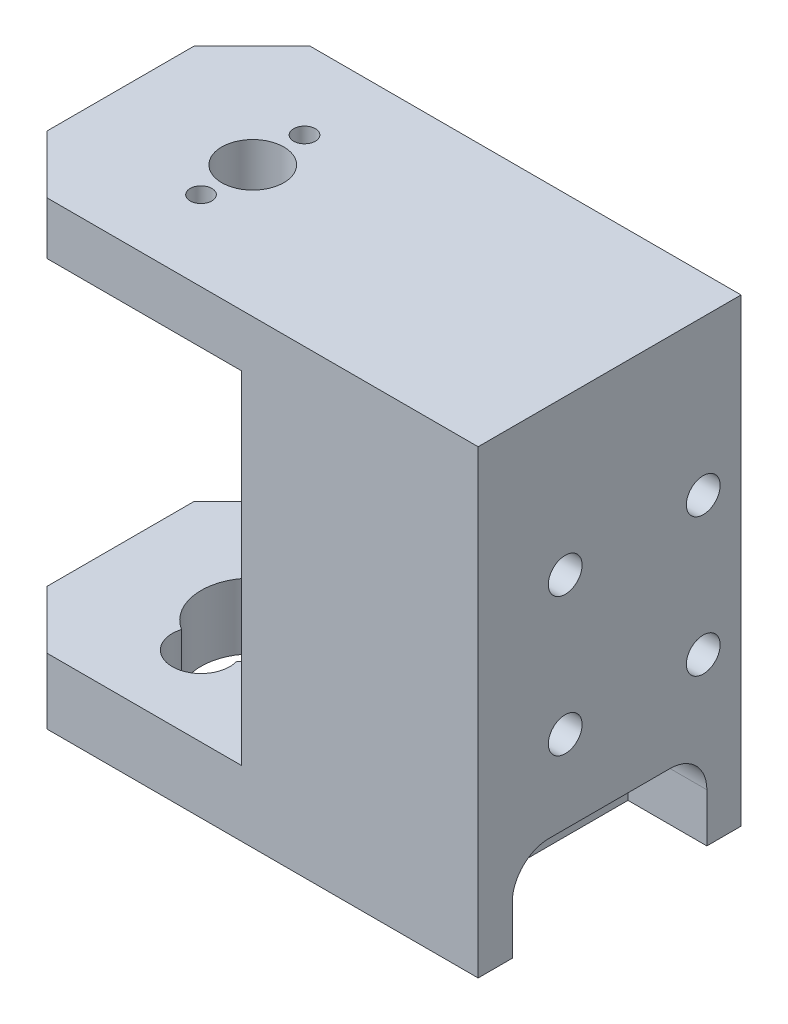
ISO-10303-21;
HEADER;
FILE_DESCRIPTION(('STEP AP214'),'2;1');
FILE_NAME('part.step','',(''),(''),'','','');
FILE_SCHEMA(('AUTOMOTIVE_DESIGN { 1 0 10303 214 1 1 1 1 }'));
ENDSEC;
DATA;
#1=APPLICATION_CONTEXT('core data for automotive mechanical design processes');
#2=APPLICATION_PROTOCOL_DEFINITION('international standard','automotive_design',2000,#1);
#3=PRODUCT_CONTEXT('',#1,'mechanical');
#4=PRODUCT('Part','Part','',(#3));
#5=PRODUCT_RELATED_PRODUCT_CATEGORY('part','',(#4));
#6=PRODUCT_DEFINITION_FORMATION('','',#4);
#7=PRODUCT_DEFINITION_CONTEXT('part definition',#1,'design');
#8=PRODUCT_DEFINITION('design','',#6,#7);
#9=PRODUCT_DEFINITION_SHAPE('','',#8);
#10=(LENGTH_UNIT() NAMED_UNIT(*) SI_UNIT(.MILLI.,.METRE.));
#11=(NAMED_UNIT(*) PLANE_ANGLE_UNIT() SI_UNIT($,.RADIAN.));
#12=(NAMED_UNIT(*) SI_UNIT($,.STERADIAN.) SOLID_ANGLE_UNIT());
#13=UNCERTAINTY_MEASURE_WITH_UNIT(LENGTH_MEASURE(1.E-05),#10,'distance_accuracy_value','');
#14=(GEOMETRIC_REPRESENTATION_CONTEXT(3) GLOBAL_UNCERTAINTY_ASSIGNED_CONTEXT((#13)) GLOBAL_UNIT_ASSIGNED_CONTEXT((#10,
#11,#12)) REPRESENTATION_CONTEXT('',''));
#15=CARTESIAN_POINT('',(0.,0.,0.));
#16=DIRECTION('',(0.,0.,1.));
#17=DIRECTION('',(1.,0.,0.));
#18=AXIS2_PLACEMENT_3D('',#15,#16,#17);
#19=CARTESIAN_POINT('',(-34.47288,0.001000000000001,0.));
#20=DIRECTION('',(0.,-1.,0.));
#21=DIRECTION('',(0.,0.,-1.));
#22=AXIS2_PLACEMENT_3D('',#19,#20,#21);
#23=CYLINDRICAL_SURFACE('',#22,4.9911);
#24=CARTESIAN_POINT('',(-34.47288,-38.1,0.));
#25=DIRECTION('',(0.,1.,0.));
#26=DIRECTION('',(0.,0.,1.));
#27=AXIS2_PLACEMENT_3D('',#24,#25,#26);
#28=CIRCLE('',#27,4.9911);
#29=CARTESIAN_POINT('',(-37.1396181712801,-38.1,4.21895564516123));
#30=VERTEX_POINT('',#29);
#31=CARTESIAN_POINT('',(-37.1396181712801,-38.1,-4.21895564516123));
#32=VERTEX_POINT('',#31);
#33=EDGE_CURVE('E562',#30,#32,#28,.F.);
#34=ORIENTED_EDGE('',*,*,#33,.F.);
#35=DIRECTION('',(0.,-1.,0.));
#36=VECTOR('',#35,1.);
#37=CARTESIAN_POINT('',(-37.1396181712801,-41.275,4.21895564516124));
#38=LINE('',#37,#36);
#39=CARTESIAN_POINT('',(-37.1396181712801,-44.45,4.21895564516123));
#40=VERTEX_POINT('',#39);
#41=EDGE_CURVE('E422',#30,#40,#38,.T.);
#42=ORIENTED_EDGE('',*,*,#41,.T.);
#43=CARTESIAN_POINT('',(-34.47288,-44.45,0.));
#44=DIRECTION('',(0.,-1.,0.));
#45=DIRECTION('',(0.,0.,-1.));
#46=AXIS2_PLACEMENT_3D('',#43,#44,#45);
#47=CIRCLE('',#46,4.9911);
#48=CARTESIAN_POINT('',(-37.1396181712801,-44.45,-4.21895564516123));
#49=VERTEX_POINT('',#48);
#50=EDGE_CURVE('E564',#40,#49,#47,.T.);
#51=ORIENTED_EDGE('',*,*,#50,.T.);
#52=DIRECTION('',(0.,-1.,0.));
#53=VECTOR('',#52,1.);
#54=CARTESIAN_POINT('',(-37.1396181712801,-41.275,-4.21895564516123));
#55=LINE('',#54,#53);
#56=EDGE_CURVE('E407',#49,#32,#55,.F.);
#57=ORIENTED_EDGE('',*,*,#56,.T.);
#58=EDGE_LOOP('',(#34,#42,#51,#57));
#59=FACE_BOUND('',#58,.T.);
#60=ADVANCED_FACE('F32',(#59),#23,.F.);
#61=CARTESIAN_POINT('',(-47.2440000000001,0.,-12.7));
#62=DIRECTION('',(0.,0.,1.));
#63=DIRECTION('',(-1.,0.,0.));
#64=AXIS2_PLACEMENT_3D('',#61,#62,#63);
#65=PLANE('',#64);
#66=CARTESIAN_POINT('',(-10.3854250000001,-41.275,-12.7));
#67=DIRECTION('',(0.,0.,-1.));
#68=DIRECTION('',(-1.,0.,0.));
#69=AXIS2_PLACEMENT_3D('',#66,#67,#68);
#70=CIRCLE('',#69,1.28905);
#71=CARTESIAN_POINT('',(-11.6744750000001,-41.275,-12.7));
#72=VERTEX_POINT('',#71);
#73=EDGE_CURVE('E533',#72,#72,#70,.T.);
#74=ORIENTED_EDGE('',*,*,#73,.F.);
#75=EDGE_LOOP('',(#74));
#76=FACE_BOUND('',#75,.T.);
#77=DIRECTION('',(1.,0.,0.));
#78=VECTOR('',#77,1.);
#79=CARTESIAN_POINT('',(-1.26999999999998,-44.45,-12.7));
#80=LINE('',#79,#78);
#81=CARTESIAN_POINT('',(-13.8652250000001,-44.45,-12.7));
#82=VERTEX_POINT('',#81);
#83=CARTESIAN_POINT('',(0.,-44.45,-12.7));
#84=VERTEX_POINT('',#83);
#85=EDGE_CURVE('E260',#82,#84,#80,.T.);
#86=ORIENTED_EDGE('',*,*,#85,.F.);
#87=DIRECTION('',(0.,-1.,0.));
#88=VECTOR('',#87,1.);
#89=CARTESIAN_POINT('',(-13.8652250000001,-31.75,-12.7));
#90=LINE('',#89,#88);
#91=CARTESIAN_POINT('',(-13.8652250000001,-38.1,-12.7));
#92=VERTEX_POINT('',#91);
#93=EDGE_CURVE('E544',#92,#82,#90,.T.);
#94=ORIENTED_EDGE('',*,*,#93,.F.);
#95=DIRECTION('',(1.,0.,0.));
#96=VECTOR('',#95,1.);
#97=CARTESIAN_POINT('',(-1.26999999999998,-38.1,-12.7));
#98=LINE('',#97,#96);
#99=CARTESIAN_POINT('',(-12.954,-38.1,-12.7));
#100=VERTEX_POINT('',#99);
#101=EDGE_CURVE('E279',#92,#100,#98,.T.);
#102=ORIENTED_EDGE('',*,*,#101,.T.);
#103=CARTESIAN_POINT('',(-12.954,-31.496,-12.7));
#104=DIRECTION('',(0.,0.,1.));
#105=DIRECTION('',(1.,0.,0.));
#106=AXIS2_PLACEMENT_3D('',#103,#104,#105);
#107=CIRCLE('',#106,6.604);
#108=CARTESIAN_POINT('',(-6.34999999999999,-31.496,-12.7));
#109=VERTEX_POINT('',#108);
#110=EDGE_CURVE('E408',#100,#109,#107,.T.);
#111=ORIENTED_EDGE('',*,*,#110,.T.);
#112=DIRECTION('',(0.,-1.,0.));
#113=VECTOR('',#112,1.);
#114=CARTESIAN_POINT('',(-6.35,-5.08,-12.7));
#115=LINE('',#114,#113);
#116=CARTESIAN_POINT('',(-6.35,-11.684,-12.7));
#117=VERTEX_POINT('',#116);
#118=EDGE_CURVE('E298',#117,#109,#115,.T.);
#119=ORIENTED_EDGE('',*,*,#118,.F.);
#120=CARTESIAN_POINT('',(-12.954,-11.684,-12.7));
#121=DIRECTION('',(0.,0.,1.));
#122=DIRECTION('',(1.,0.,0.));
#123=AXIS2_PLACEMENT_3D('',#120,#121,#122);
#124=CIRCLE('',#123,6.604);
#125=CARTESIAN_POINT('',(-12.954,-5.08,-12.7));
#126=VERTEX_POINT('',#125);
#127=EDGE_CURVE('E405',#117,#126,#124,.T.);
#128=ORIENTED_EDGE('',*,*,#127,.T.);
#129=DIRECTION('',(1.,0.,0.));
#130=VECTOR('',#129,1.);
#131=CARTESIAN_POINT('',(-6.35,-5.08,-12.7));
#132=LINE('',#131,#130);
#133=CARTESIAN_POINT('',(-41.656,-5.08,-12.7));
#134=VERTEX_POINT('',#133);
#135=EDGE_CURVE('E302',#134,#126,#132,.T.);
#136=ORIENTED_EDGE('',*,*,#135,.F.);
#137=DIRECTION('',(0.,1.,0.));
#138=VECTOR('',#137,1.);
#139=CARTESIAN_POINT('',(-41.656,0.,-12.7));
#140=LINE('',#139,#138);
#141=CARTESIAN_POINT('',(-41.656,0.,-12.7));
#142=VERTEX_POINT('',#141);
#143=EDGE_CURVE('E353',#134,#142,#140,.T.);
#144=ORIENTED_EDGE('',*,*,#143,.T.);
#145=DIRECTION('',(-1.,0.,0.));
#146=VECTOR('',#145,1.);
#147=CARTESIAN_POINT('',(-47.2440000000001,0.,-12.7));
#148=LINE('',#147,#146);
#149=CARTESIAN_POINT('',(0.,0.,-12.7));
#150=VERTEX_POINT('',#149);
#151=EDGE_CURVE('E303',#150,#142,#148,.T.);
#152=ORIENTED_EDGE('',*,*,#151,.F.);
#153=DIRECTION('',(0.,-1.,0.));
#154=VECTOR('',#153,1.);
#155=CARTESIAN_POINT('',(0.,-44.45,-12.7));
#156=LINE('',#155,#154);
#157=EDGE_CURVE('E560',#150,#84,#156,.T.);
#158=ORIENTED_EDGE('',*,*,#157,.T.);
#159=EDGE_LOOP('',(#86,#94,#102,#111,#119,#128,#136,#144,#152,#158));
#160=FACE_BOUND('',#159,.T.);
#161=ADVANCED_FACE('F403',(#76,#160),#65,.F.);
#162=CARTESIAN_POINT('',(-29.4354250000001,-41.275,-12.7));
#163=DIRECTION('',(0.,0.,-1.));
#164=DIRECTION('',(-1.,0.,0.));
#165=AXIS2_PLACEMENT_3D('',#162,#163,#164);
#166=CIRCLE('',#165,1.28905);
#167=CARTESIAN_POINT('',(-30.7244750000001,-41.275,-12.7));
#168=VERTEX_POINT('',#167);
#169=EDGE_CURVE('E527',#168,#168,#166,.T.);
#170=ORIENTED_EDGE('',*,*,#169,.F.);
#171=EDGE_LOOP('',(#170));
#172=FACE_BOUND('',#171,.T.);
#173=CARTESIAN_POINT('',(-41.656,-38.1,-12.7));
#174=VERTEX_POINT('',#173);
#175=CARTESIAN_POINT('',(-25.0412250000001,-38.1,-12.7));
#176=VERTEX_POINT('',#175);
#177=EDGE_CURVE('E285',#174,#176,#98,.T.);
#178=ORIENTED_EDGE('',*,*,#177,.T.);
#179=DIRECTION('',(0.,-1.,0.));
#180=VECTOR('',#179,1.);
#181=CARTESIAN_POINT('',(-25.0412250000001,-31.75,-12.7));
#182=LINE('',#181,#180);
#183=CARTESIAN_POINT('',(-25.0412250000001,-44.45,-12.7));
#184=VERTEX_POINT('',#183);
#185=EDGE_CURVE('E547',#176,#184,#182,.T.);
#186=ORIENTED_EDGE('',*,*,#185,.T.);
#187=CARTESIAN_POINT('',(-41.656,-44.45,-12.7));
#188=VERTEX_POINT('',#187);
#189=EDGE_CURVE('E255',#188,#184,#80,.T.);
#190=ORIENTED_EDGE('',*,*,#189,.F.);
#191=DIRECTION('',(0.,1.,0.));
#192=VECTOR('',#191,1.);
#193=CARTESIAN_POINT('',(-41.656,0.,-12.7));
#194=LINE('',#193,#192);
#195=EDGE_CURVE('E355',#188,#174,#194,.T.);
#196=ORIENTED_EDGE('',*,*,#195,.T.);
#197=EDGE_LOOP('',(#178,#186,#190,#196));
#198=FACE_BOUND('',#197,.T.);
#199=ADVANCED_FACE('F586',(#172,#198),#65,.F.);
#200=CARTESIAN_POINT('',(-47.2440000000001,-5.08,12.7));
#201=DIRECTION('',(1.,0.,0.));
#202=DIRECTION('',(0.,0.,-1.));
#203=AXIS2_PLACEMENT_3D('',#200,#201,#202);
#204=PLANE('',#203);
#205=DIRECTION('',(0.,0.,-1.));
#206=VECTOR('',#205,1.);
#207=CARTESIAN_POINT('',(-47.2440000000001,0.,12.7));
#208=LINE('',#207,#206);
#209=CARTESIAN_POINT('',(-47.2440000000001,0.,7.11199999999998));
#210=VERTEX_POINT('',#209);
#211=CARTESIAN_POINT('',(-47.2440000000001,0.,-7.11199999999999));
#212=VERTEX_POINT('',#211);
#213=EDGE_CURVE('E346',#210,#212,#208,.T.);
#214=ORIENTED_EDGE('',*,*,#213,.T.);
#215=DIRECTION('',(0.,-1.,0.));
#216=VECTOR('',#215,1.);
#217=CARTESIAN_POINT('',(-47.2440000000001,-5.08,-7.11199999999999));
#218=LINE('',#217,#216);
#219=CARTESIAN_POINT('',(-47.2440000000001,-5.08,-7.11199999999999));
#220=VERTEX_POINT('',#219);
#221=EDGE_CURVE('E382',#212,#220,#218,.T.);
#222=ORIENTED_EDGE('',*,*,#221,.T.);
#223=DIRECTION('',(0.,0.,-1.));
#224=VECTOR('',#223,1.);
#225=CARTESIAN_POINT('',(-47.2440000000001,-5.08,12.7));
#226=LINE('',#225,#224);
#227=CARTESIAN_POINT('',(-47.2440000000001,-5.08,7.11199999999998));
#228=VERTEX_POINT('',#227);
#229=EDGE_CURVE('E308',#228,#220,#226,.T.);
#230=ORIENTED_EDGE('',*,*,#229,.F.);
#231=DIRECTION('',(0.,1.,0.));
#232=VECTOR('',#231,1.);
#233=CARTESIAN_POINT('',(-47.2440000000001,-5.08,7.11199999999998));
#234=LINE('',#233,#232);
#235=EDGE_CURVE('E380',#228,#210,#234,.T.);
#236=ORIENTED_EDGE('',*,*,#235,.T.);
#237=EDGE_LOOP('',(#214,#222,#230,#236));
#238=FACE_BOUND('',#237,.T.);
#239=ADVANCED_FACE('F34',(#238),#204,.F.);
#240=CARTESIAN_POINT('',(-6.35,-5.08,12.7));
#241=DIRECTION('',(0.,1.,0.));
#242=DIRECTION('',(-1.,0.,0.));
#243=AXIS2_PLACEMENT_3D('',#240,#241,#242);
#244=PLANE('',#243);
#245=CARTESIAN_POINT('',(-34.4728800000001,-5.08,4.99999));
#246=DIRECTION('',(0.,-1.,0.));
#247=DIRECTION('',(0.,0.,-1.));
#248=AXIS2_PLACEMENT_3D('',#245,#246,#247);
#249=CIRCLE('',#248,1.985);
#250=CARTESIAN_POINT('',(-34.4728800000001,-5.08,3.01499));
#251=VERTEX_POINT('',#250);
#252=EDGE_CURVE('E479',#251,#251,#249,.T.);
#253=ORIENTED_EDGE('',*,*,#252,.F.);
#254=EDGE_LOOP('',(#253));
#255=FACE_BOUND('',#254,.T.);
#256=CARTESIAN_POINT('',(-34.4728800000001,-5.08,-4.99999));
#257=DIRECTION('',(0.,-1.,0.));
#258=DIRECTION('',(0.,0.,-1.));
#259=AXIS2_PLACEMENT_3D('',#256,#257,#258);
#260=CIRCLE('',#259,1.985);
#261=CARTESIAN_POINT('',(-34.4728800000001,-5.08,-6.98499));
#262=VERTEX_POINT('',#261);
#263=EDGE_CURVE('E491',#262,#262,#260,.T.);
#264=ORIENTED_EDGE('',*,*,#263,.F.);
#265=EDGE_LOOP('',(#264));
#266=FACE_BOUND('',#265,.T.);
#267=ORIENTED_EDGE('',*,*,#135,.T.);
#268=DIRECTION('',(0.,0.,-1.));
#269=VECTOR('',#268,1.);
#270=CARTESIAN_POINT('',(-12.954,-5.08,7.9375));
#271=LINE('',#270,#269);
#272=CARTESIAN_POINT('',(-12.954,-5.08,7.9375));
#273=VERTEX_POINT('',#272);
#274=EDGE_CURVE('E413',#126,#273,#271,.F.);
#275=ORIENTED_EDGE('',*,*,#274,.T.);
#276=DIRECTION('',(-1.,0.,0.));
#277=VECTOR('',#276,1.);
#278=CARTESIAN_POINT('',(-6.35,-5.08,7.9375));
#279=LINE('',#278,#277);
#280=CARTESIAN_POINT('',(-22.86,-5.08,7.9375));
#281=VERTEX_POINT('',#280);
#282=EDGE_CURVE('E321',#273,#281,#279,.T.);
#283=ORIENTED_EDGE('',*,*,#282,.T.);
#284=DIRECTION('',(0.,0.,1.));
#285=VECTOR('',#284,1.);
#286=CARTESIAN_POINT('',(-22.86,-5.08,7.9375));
#287=LINE('',#286,#285);
#288=CARTESIAN_POINT('',(-22.86,-5.08,12.7));
#289=VERTEX_POINT('',#288);
#290=EDGE_CURVE('E312',#281,#289,#287,.T.);
#291=ORIENTED_EDGE('',*,*,#290,.T.);
#292=DIRECTION('',(1.,0.,0.));
#293=VECTOR('',#292,1.);
#294=CARTESIAN_POINT('',(-6.35,-5.08,12.7));
#295=LINE('',#294,#293);
#296=CARTESIAN_POINT('',(-41.656,-5.08,12.7));
#297=VERTEX_POINT('',#296);
#298=EDGE_CURVE('E341',#297,#289,#295,.T.);
#299=ORIENTED_EDGE('',*,*,#298,.F.);
#300=DIRECTION('',(0.707106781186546,0.,0.707106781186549));
#301=VECTOR('',#300,1.);
#302=CARTESIAN_POINT('',(-41.656,-5.08,12.7));
#303=LINE('',#302,#301);
#304=EDGE_CURVE('E385',#297,#228,#303,.F.);
#305=ORIENTED_EDGE('',*,*,#304,.T.);
#306=ORIENTED_EDGE('',*,*,#229,.T.);
#307=DIRECTION('',(-0.707106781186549,0.,0.707106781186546));
#308=VECTOR('',#307,1.);
#309=CARTESIAN_POINT('',(-47.2440000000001,-5.08,-7.11199999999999));
#310=LINE('',#309,#308);
#311=EDGE_CURVE('E387',#220,#134,#310,.F.);
#312=ORIENTED_EDGE('',*,*,#311,.T.);
#313=EDGE_LOOP('',(#267,#275,#283,#291,#299,#305,#306,#312));
#314=FACE_BOUND('',#313,.T.);
#315=CARTESIAN_POINT('',(-34.4728800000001,-5.08,0.));
#316=DIRECTION('',(0.,1.,0.));
#317=DIRECTION('',(-1.,0.,0.));
#318=AXIS2_PLACEMENT_3D('',#315,#316,#317);
#319=CIRCLE('',#318,2.9972);
#320=CARTESIAN_POINT('',(-37.4700800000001,-5.08,0.));
#321=VERTEX_POINT('',#320);
#322=EDGE_CURVE('E497',#321,#321,#319,.F.);
#323=ORIENTED_EDGE('',*,*,#322,.F.);
#324=EDGE_LOOP('',(#323));
#325=FACE_BOUND('',#324,.T.);
#326=ADVANCED_FACE('F399',(#255,#266,#314,#325),#244,.F.);
#327=CARTESIAN_POINT('',(-6.35,-5.08,12.7));
#328=DIRECTION('',(1.,0.,0.));
#329=DIRECTION('',(0.,1.,0.));
#330=AXIS2_PLACEMENT_3D('',#327,#328,#329);
#331=PLANE('',#330);
#332=CARTESIAN_POINT('',(-6.35,-14.9225,4.28625));
#333=DIRECTION('',(1.,0.,0.));
#334=DIRECTION('',(0.,1.,0.));
#335=AXIS2_PLACEMENT_3D('',#332,#333,#334);
#336=CIRCLE('',#335,1.63194999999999);
#337=CARTESIAN_POINT('',(-6.35,-13.29055,4.28625));
#338=VERTEX_POINT('',#337);
#339=EDGE_CURVE('E503',#338,#338,#336,.T.);
#340=ORIENTED_EDGE('',*,*,#339,.T.);
#341=EDGE_LOOP('',(#340));
#342=FACE_BOUND('',#341,.T.);
#343=CARTESIAN_POINT('',(-6.35,-14.9225,-9.04875));
#344=DIRECTION('',(1.,0.,0.));
#345=DIRECTION('',(0.,1.,0.));
#346=AXIS2_PLACEMENT_3D('',#343,#344,#345);
#347=CIRCLE('',#346,1.63194999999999);
#348=CARTESIAN_POINT('',(-6.35,-13.29055,-9.04875));
#349=VERTEX_POINT('',#348);
#350=EDGE_CURVE('E509',#349,#349,#347,.T.);
#351=ORIENTED_EDGE('',*,*,#350,.T.);
#352=EDGE_LOOP('',(#351));
#353=FACE_BOUND('',#352,.T.);
#354=CARTESIAN_POINT('',(-6.34999999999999,-28.2575,4.28625));
#355=DIRECTION('',(1.,0.,0.));
#356=DIRECTION('',(0.,1.,0.));
#357=AXIS2_PLACEMENT_3D('',#354,#355,#356);
#358=CIRCLE('',#357,1.63194999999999);
#359=CARTESIAN_POINT('',(-6.34999999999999,-26.62555,4.28625));
#360=VERTEX_POINT('',#359);
#361=EDGE_CURVE('E515',#360,#360,#358,.T.);
#362=ORIENTED_EDGE('',*,*,#361,.T.);
#363=EDGE_LOOP('',(#362));
#364=FACE_BOUND('',#363,.T.);
#365=CARTESIAN_POINT('',(-6.34999999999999,-28.2575,-9.04875));
#366=DIRECTION('',(1.,0.,0.));
#367=DIRECTION('',(0.,1.,0.));
#368=AXIS2_PLACEMENT_3D('',#365,#366,#367);
#369=CIRCLE('',#368,1.63194999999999);
#370=CARTESIAN_POINT('',(-6.34999999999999,-26.62555,-9.04875));
#371=VERTEX_POINT('',#370);
#372=EDGE_CURVE('E521',#371,#371,#369,.T.);
#373=ORIENTED_EDGE('',*,*,#372,.T.);
#374=EDGE_LOOP('',(#373));
#375=FACE_BOUND('',#374,.T.);
#376=ORIENTED_EDGE('',*,*,#118,.T.);
#377=DIRECTION('',(0.,0.,-1.));
#378=VECTOR('',#377,1.);
#379=CARTESIAN_POINT('',(-6.34999999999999,-31.496,12.7));
#380=LINE('',#379,#378);
#381=CARTESIAN_POINT('',(-6.34999999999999,-31.496,7.9375));
#382=VERTEX_POINT('',#381);
#383=EDGE_CURVE('E753',#109,#382,#380,.F.);
#384=ORIENTED_EDGE('',*,*,#383,.T.);
#385=DIRECTION('',(0.,1.,0.));
#386=VECTOR('',#385,1.);
#387=CARTESIAN_POINT('',(-6.35,-5.08,7.9375));
#388=LINE('',#387,#386);
#389=CARTESIAN_POINT('',(-6.35,-11.684,7.9375));
#390=VERTEX_POINT('',#389);
#391=EDGE_CURVE('E270',#382,#390,#388,.T.);
#392=ORIENTED_EDGE('',*,*,#391,.T.);
#393=DIRECTION('',(0.,0.,-1.));
#394=VECTOR('',#393,1.);
#395=CARTESIAN_POINT('',(-6.35,-11.684,-12.7));
#396=LINE('',#395,#394);
#397=EDGE_CURVE('E297',#390,#117,#396,.T.);
#398=ORIENTED_EDGE('',*,*,#397,.T.);
#399=EDGE_LOOP('',(#376,#384,#392,#398));
#400=FACE_BOUND('',#399,.T.);
#401=ADVANCED_FACE('F626',(#342,#353,#364,#375,#400),#331,.F.);
#402=CARTESIAN_POINT('',(0.,0.,12.7));
#403=DIRECTION('',(-1.,0.,0.));
#404=DIRECTION('',(0.,-1.,0.));
#405=AXIS2_PLACEMENT_3D('',#402,#403,#404);
#406=PLANE('',#405);
#407=CARTESIAN_POINT('',(0.,-14.9225,4.28625));
#408=DIRECTION('',(1.,0.,0.));
#409=DIRECTION('',(0.,0.,-1.));
#410=AXIS2_PLACEMENT_3D('',#407,#408,#409);
#411=CIRCLE('',#410,1.63194999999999);
#412=CARTESIAN_POINT('',(0.,-14.9225,2.65430000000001));
#413=VERTEX_POINT('',#412);
#414=EDGE_CURVE('E500',#413,#413,#411,.T.);
#415=ORIENTED_EDGE('',*,*,#414,.F.);
#416=EDGE_LOOP('',(#415));
#417=FACE_BOUND('',#416,.T.);
#418=CARTESIAN_POINT('',(0.,-14.9225,-9.04875));
#419=DIRECTION('',(1.,0.,0.));
#420=DIRECTION('',(0.,0.,-1.));
#421=AXIS2_PLACEMENT_3D('',#418,#419,#420);
#422=CIRCLE('',#421,1.63194999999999);
#423=CARTESIAN_POINT('',(0.,-14.9225,-10.6807));
#424=VERTEX_POINT('',#423);
#425=EDGE_CURVE('E506',#424,#424,#422,.T.);
#426=ORIENTED_EDGE('',*,*,#425,.F.);
#427=EDGE_LOOP('',(#426));
#428=FACE_BOUND('',#427,.T.);
#429=CARTESIAN_POINT('',(0.,-28.2575,4.28625));
#430=DIRECTION('',(1.,0.,0.));
#431=DIRECTION('',(0.,0.,-1.));
#432=AXIS2_PLACEMENT_3D('',#429,#430,#431);
#433=CIRCLE('',#432,1.63194999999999);
#434=CARTESIAN_POINT('',(0.,-28.2575,2.65430000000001));
#435=VERTEX_POINT('',#434);
#436=EDGE_CURVE('E512',#435,#435,#433,.T.);
#437=ORIENTED_EDGE('',*,*,#436,.F.);
#438=EDGE_LOOP('',(#437));
#439=FACE_BOUND('',#438,.T.);
#440=CARTESIAN_POINT('',(0.,-28.2575,-9.04875));
#441=DIRECTION('',(1.,0.,0.));
#442=DIRECTION('',(0.,0.,-1.));
#443=AXIS2_PLACEMENT_3D('',#440,#441,#442);
#444=CIRCLE('',#443,1.63194999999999);
#445=CARTESIAN_POINT('',(0.,-28.2575,-10.6807));
#446=VERTEX_POINT('',#445);
#447=EDGE_CURVE('E518',#446,#446,#444,.T.);
#448=ORIENTED_EDGE('',*,*,#447,.F.);
#449=EDGE_LOOP('',(#448));
#450=FACE_BOUND('',#449,.T.);
#451=DIRECTION('',(0.,0.,1.));
#452=VECTOR('',#451,1.);
#453=CARTESIAN_POINT('',(0.,-44.45,8.9916));
#454=LINE('',#453,#452);
#455=CARTESIAN_POINT('',(0.,-44.45,9.398));
#456=VERTEX_POINT('',#455);
#457=CARTESIAN_POINT('',(0.,-44.45,12.7));
#458=VERTEX_POINT('',#457);
#459=EDGE_CURVE('E242',#456,#458,#454,.T.);
#460=ORIENTED_EDGE('',*,*,#459,.F.);
#461=DIRECTION('',(0.,-1.,0.));
#462=VECTOR('',#461,1.);
#463=CARTESIAN_POINT('',(0.,-44.45,9.398));
#464=LINE('',#463,#462);
#465=CARTESIAN_POINT('',(0.,-39.751,9.398));
#466=VERTEX_POINT('',#465);
#467=EDGE_CURVE('E229',#466,#456,#464,.T.);
#468=ORIENTED_EDGE('',*,*,#467,.F.);
#469=CARTESIAN_POINT('',(0.,-39.751,5.842));
#470=DIRECTION('',(-1.,0.,0.));
#471=DIRECTION('',(0.,-1.,0.));
#472=AXIS2_PLACEMENT_3D('',#469,#470,#471);
#473=CIRCLE('',#472,3.556);
#474=CARTESIAN_POINT('',(0.,-36.195,5.842));
#475=VERTEX_POINT('',#474);
#476=EDGE_CURVE('E11',#466,#475,#473,.T.);
#477=ORIENTED_EDGE('',*,*,#476,.T.);
#478=DIRECTION('',(0.,0.,1.));
#479=VECTOR('',#478,1.);
#480=CARTESIAN_POINT('',(0.,-36.195,9.398));
#481=LINE('',#480,#479);
#482=CARTESIAN_POINT('',(0.,-36.195,-5.842));
#483=VERTEX_POINT('',#482);
#484=EDGE_CURVE('E440',#483,#475,#481,.T.);
#485=ORIENTED_EDGE('',*,*,#484,.F.);
#486=CARTESIAN_POINT('',(0.,-39.751,-5.842));
#487=DIRECTION('',(-1.,0.,0.));
#488=DIRECTION('',(0.,-1.,0.));
#489=AXIS2_PLACEMENT_3D('',#486,#487,#488);
#490=CIRCLE('',#489,3.556);
#491=CARTESIAN_POINT('',(0.,-39.751,-9.398));
#492=VERTEX_POINT('',#491);
#493=EDGE_CURVE('E40',#483,#492,#490,.T.);
#494=ORIENTED_EDGE('',*,*,#493,.T.);
#495=DIRECTION('',(0.,1.,0.));
#496=VECTOR('',#495,1.);
#497=CARTESIAN_POINT('',(0.,-44.45,-9.398));
#498=LINE('',#497,#496);
#499=CARTESIAN_POINT('',(0.,-44.45,-9.398));
#500=VERTEX_POINT('',#499);
#501=EDGE_CURVE('E237',#500,#492,#498,.T.);
#502=ORIENTED_EDGE('',*,*,#501,.F.);
#503=EDGE_CURVE('E254',#84,#500,#454,.T.);
#504=ORIENTED_EDGE('',*,*,#503,.F.);
#505=ORIENTED_EDGE('',*,*,#157,.F.);
#506=DIRECTION('',(0.,0.,-1.));
#507=VECTOR('',#506,1.);
#508=CARTESIAN_POINT('',(0.,0.,12.7));
#509=LINE('',#508,#507);
#510=CARTESIAN_POINT('',(0.,0.,12.7));
#511=VERTEX_POINT('',#510);
#512=EDGE_CURVE('E348',#511,#150,#509,.T.);
#513=ORIENTED_EDGE('',*,*,#512,.F.);
#514=DIRECTION('',(0.,-1.,0.));
#515=VECTOR('',#514,1.);
#516=CARTESIAN_POINT('',(0.,-44.45,12.7));
#517=LINE('',#516,#515);
#518=EDGE_CURVE('E253',#511,#458,#517,.T.);
#519=ORIENTED_EDGE('',*,*,#518,.T.);
#520=EDGE_LOOP('',(#460,#468,#477,#485,#494,#502,#504,#505,#513,#519));
#521=FACE_BOUND('',#520,.T.);
#522=ADVANCED_FACE('F251',(#417,#428,#439,#450,#521),#406,.F.);
#523=CARTESIAN_POINT('',(-47.2440000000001,0.,12.7));
#524=DIRECTION('',(0.,-1.,0.));
#525=DIRECTION('',(0.,0.,-1.));
#526=AXIS2_PLACEMENT_3D('',#523,#524,#525);
#527=PLANE('',#526);
#528=CARTESIAN_POINT('',(-34.4728800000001,0.,4.99999));
#529=DIRECTION('',(0.,-1.,0.));
#530=DIRECTION('',(0.,0.,-1.));
#531=AXIS2_PLACEMENT_3D('',#528,#529,#530);
#532=CIRCLE('',#531,1.05);
#533=CARTESIAN_POINT('',(-34.4728800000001,0.,3.94999));
#534=VERTEX_POINT('',#533);
#535=EDGE_CURVE('E470',#534,#534,#532,.T.);
#536=ORIENTED_EDGE('',*,*,#535,.T.);
#537=EDGE_LOOP('',(#536));
#538=FACE_BOUND('',#537,.T.);
#539=CARTESIAN_POINT('',(-34.4728800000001,0.,-4.99999));
#540=DIRECTION('',(0.,-1.,0.));
#541=DIRECTION('',(0.,0.,-1.));
#542=AXIS2_PLACEMENT_3D('',#539,#540,#541);
#543=CIRCLE('',#542,1.05);
#544=CARTESIAN_POINT('',(-34.4728800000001,0.,-6.04999));
#545=VERTEX_POINT('',#544);
#546=EDGE_CURVE('E482',#545,#545,#543,.T.);
#547=ORIENTED_EDGE('',*,*,#546,.T.);
#548=EDGE_LOOP('',(#547));
#549=FACE_BOUND('',#548,.T.);
#550=ORIENTED_EDGE('',*,*,#151,.T.);
#551=DIRECTION('',(0.707106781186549,0.,-0.707106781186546));
#552=VECTOR('',#551,1.);
#553=CARTESIAN_POINT('',(-47.2440000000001,0.,-7.11199999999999));
#554=LINE('',#553,#552);
#555=EDGE_CURVE('E292',#142,#212,#554,.F.);
#556=ORIENTED_EDGE('',*,*,#555,.T.);
#557=ORIENTED_EDGE('',*,*,#213,.F.);
#558=DIRECTION('',(-0.707106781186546,0.,-0.707106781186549));
#559=VECTOR('',#558,1.);
#560=CARTESIAN_POINT('',(-41.656,0.,12.7));
#561=LINE('',#560,#559);
#562=CARTESIAN_POINT('',(-41.656,0.,12.7));
#563=VERTEX_POINT('',#562);
#564=EDGE_CURVE('E388',#210,#563,#561,.F.);
#565=ORIENTED_EDGE('',*,*,#564,.T.);
#566=DIRECTION('',(-1.,0.,0.));
#567=VECTOR('',#566,1.);
#568=CARTESIAN_POINT('',(-47.2440000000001,0.,12.7));
#569=LINE('',#568,#567);
#570=EDGE_CURVE('E343',#511,#563,#569,.T.);
#571=ORIENTED_EDGE('',*,*,#570,.F.);
#572=ORIENTED_EDGE('',*,*,#512,.T.);
#573=EDGE_LOOP('',(#550,#556,#557,#565,#571,#572));
#574=FACE_BOUND('',#573,.T.);
#575=CARTESIAN_POINT('',(-34.4728800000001,0.,0.));
#576=DIRECTION('',(0.,1.,0.));
#577=DIRECTION('',(-1.,0.,0.));
#578=AXIS2_PLACEMENT_3D('',#575,#576,#577);
#579=CIRCLE('',#578,2.9972);
#580=CARTESIAN_POINT('',(-37.4700800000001,0.,0.));
#581=VERTEX_POINT('',#580);
#582=EDGE_CURVE('E494',#581,#581,#579,.T.);
#583=ORIENTED_EDGE('',*,*,#582,.F.);
#584=EDGE_LOOP('',(#583));
#585=FACE_BOUND('',#584,.T.);
#586=ADVANCED_FACE('F392',(#538,#549,#574,#585),#527,.F.);
#587=CARTESIAN_POINT('',(-47.2440000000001,0.,12.7));
#588=DIRECTION('',(0.,0.,-1.));
#589=DIRECTION('',(-1.,0.,0.));
#590=AXIS2_PLACEMENT_3D('',#587,#588,#589);
#591=PLANE('',#590);
#592=DIRECTION('',(-1.,0.,0.));
#593=VECTOR('',#592,1.);
#594=CARTESIAN_POINT('',(-1.26999999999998,-38.1,12.7));
#595=LINE('',#594,#593);
#596=CARTESIAN_POINT('',(-22.86,-38.1,12.7));
#597=VERTEX_POINT('',#596);
#598=CARTESIAN_POINT('',(-41.656,-38.1,12.7));
#599=VERTEX_POINT('',#598);
#600=EDGE_CURVE('E264',#597,#599,#595,.T.);
#601=ORIENTED_EDGE('',*,*,#600,.T.);
#602=DIRECTION('',(0.,-1.,0.));
#603=VECTOR('',#602,1.);
#604=CARTESIAN_POINT('',(-41.656,0.,12.7));
#605=LINE('',#604,#603);
#606=CARTESIAN_POINT('',(-41.656,-44.45,12.7));
#607=VERTEX_POINT('',#606);
#608=EDGE_CURVE('E378',#599,#607,#605,.T.);
#609=ORIENTED_EDGE('',*,*,#608,.T.);
#610=DIRECTION('',(-1.,0.,0.));
#611=VECTOR('',#610,1.);
#612=CARTESIAN_POINT('',(-1.26999999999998,-44.45,12.7));
#613=LINE('',#612,#611);
#614=EDGE_CURVE('E282',#458,#607,#613,.T.);
#615=ORIENTED_EDGE('',*,*,#614,.F.);
#616=ORIENTED_EDGE('',*,*,#518,.F.);
#617=ORIENTED_EDGE('',*,*,#570,.T.);
#618=DIRECTION('',(0.,-1.,0.));
#619=VECTOR('',#618,1.);
#620=CARTESIAN_POINT('',(-41.656,0.,12.7));
#621=LINE('',#620,#619);
#622=EDGE_CURVE('E375',#563,#297,#621,.T.);
#623=ORIENTED_EDGE('',*,*,#622,.T.);
#624=ORIENTED_EDGE('',*,*,#298,.T.);
#625=DIRECTION('',(0.,-1.,0.));
#626=VECTOR('',#625,1.);
#627=CARTESIAN_POINT('',(-22.86,-5.08,12.7));
#628=LINE('',#627,#626);
#629=EDGE_CURVE('E258',#289,#597,#628,.T.);
#630=ORIENTED_EDGE('',*,*,#629,.T.);
#631=EDGE_LOOP('',(#601,#609,#615,#616,#617,#623,#624,#630));
#632=FACE_BOUND('',#631,.T.);
#633=ADVANCED_FACE('F614',(#632),#591,.F.);
#634=CARTESIAN_POINT('',(-22.86,-5.08,7.9375));
#635=DIRECTION('',(-1.,0.,0.));
#636=DIRECTION('',(0.,-1.,0.));
#637=AXIS2_PLACEMENT_3D('',#634,#635,#636);
#638=PLANE('',#637);
#639=ORIENTED_EDGE('',*,*,#629,.F.);
#640=ORIENTED_EDGE('',*,*,#290,.F.);
#641=DIRECTION('',(0.,-1.,0.));
#642=VECTOR('',#641,1.);
#643=CARTESIAN_POINT('',(-22.86,-5.08,7.9375));
#644=LINE('',#643,#642);
#645=CARTESIAN_POINT('',(-22.86,-38.1,7.9375));
#646=VERTEX_POINT('',#645);
#647=EDGE_CURVE('E326',#281,#646,#644,.T.);
#648=ORIENTED_EDGE('',*,*,#647,.T.);
#649=DIRECTION('',(0.,0.,1.));
#650=VECTOR('',#649,1.);
#651=CARTESIAN_POINT('',(-22.86,-38.1,7.9375));
#652=LINE('',#651,#650);
#653=EDGE_CURVE('E310',#646,#597,#652,.T.);
#654=ORIENTED_EDGE('',*,*,#653,.T.);
#655=EDGE_LOOP('',(#639,#640,#648,#654));
#656=FACE_BOUND('',#655,.T.);
#657=ADVANCED_FACE('F611',(#656),#638,.T.);
#658=CARTESIAN_POINT('',(-6.35,-5.08,7.9375));
#659=DIRECTION('',(0.,0.,-1.));
#660=DIRECTION('',(-1.,0.,0.));
#661=AXIS2_PLACEMENT_3D('',#658,#659,#660);
#662=PLANE('',#661);
#663=ORIENTED_EDGE('',*,*,#391,.F.);
#664=CARTESIAN_POINT('',(-12.954,-31.496,7.9375));
#665=DIRECTION('',(0.,0.,-1.));
#666=DIRECTION('',(-1.,0.,0.));
#667=AXIS2_PLACEMENT_3D('',#664,#665,#666);
#668=CIRCLE('',#667,6.604);
#669=CARTESIAN_POINT('',(-12.954,-38.1,7.9375));
#670=VERTEX_POINT('',#669);
#671=EDGE_CURVE('E749',#382,#670,#668,.T.);
#672=ORIENTED_EDGE('',*,*,#671,.T.);
#673=DIRECTION('',(1.,0.,0.));
#674=VECTOR('',#673,1.);
#675=CARTESIAN_POINT('',(-6.34999999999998,-38.1,7.9375));
#676=LINE('',#675,#674);
#677=EDGE_CURVE('E331',#646,#670,#676,.T.);
#678=ORIENTED_EDGE('',*,*,#677,.F.);
#679=ORIENTED_EDGE('',*,*,#647,.F.);
#680=ORIENTED_EDGE('',*,*,#282,.F.);
#681=CARTESIAN_POINT('',(-12.954,-11.684,7.9375));
#682=DIRECTION('',(0.,0.,-1.));
#683=DIRECTION('',(-1.,0.,0.));
#684=AXIS2_PLACEMENT_3D('',#681,#682,#683);
#685=CIRCLE('',#684,6.604);
#686=EDGE_CURVE('E751',#273,#390,#685,.T.);
#687=ORIENTED_EDGE('',*,*,#686,.T.);
#688=EDGE_LOOP('',(#663,#672,#678,#679,#680,#687));
#689=FACE_BOUND('',#688,.T.);
#690=ADVANCED_FACE('F608',(#689),#662,.T.);
#691=CARTESIAN_POINT('',(-1.26999999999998,-38.1,8.9916));
#692=DIRECTION('',(0.,1.,0.));
#693=DIRECTION('',(0.,0.,1.));
#694=AXIS2_PLACEMENT_3D('',#691,#692,#693);
#695=PLANE('',#694);
#696=CARTESIAN_POINT('',(-34.4728800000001,-38.1,4.99999));
#697=DIRECTION('',(0.,1.,0.));
#698=DIRECTION('',(0.,0.,1.));
#699=AXIS2_PLACEMENT_3D('',#696,#697,#698);
#700=CIRCLE('',#699,2.77876);
#701=CARTESIAN_POINT('',(-31.8061418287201,-38.1,4.21895564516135));
#702=VERTEX_POINT('',#701);
#703=EDGE_CURVE('E462',#702,#30,#700,.F.);
#704=ORIENTED_EDGE('',*,*,#703,.T.);
#705=ORIENTED_EDGE('',*,*,#33,.T.);
#706=CARTESIAN_POINT('',(-34.4728800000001,-38.1,-4.99999));
#707=DIRECTION('',(0.,1.,0.));
#708=DIRECTION('',(0.,0.,1.));
#709=AXIS2_PLACEMENT_3D('',#706,#707,#708);
#710=CIRCLE('',#709,2.77876);
#711=CARTESIAN_POINT('',(-31.8061418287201,-38.1,-4.21895564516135));
#712=VERTEX_POINT('',#711);
#713=EDGE_CURVE('E467',#32,#712,#710,.F.);
#714=ORIENTED_EDGE('',*,*,#713,.T.);
#715=EDGE_CURVE('E275',#712,#702,#28,.F.);
#716=ORIENTED_EDGE('',*,*,#715,.T.);
#717=EDGE_LOOP('',(#704,#705,#714,#716));
#718=FACE_BOUND('',#717,.T.);
#719=ORIENTED_EDGE('',*,*,#677,.T.);
#720=DIRECTION('',(0.,0.,-1.));
#721=VECTOR('',#720,1.);
#722=CARTESIAN_POINT('',(-12.954,-38.1,8.9916));
#723=LINE('',#722,#721);
#724=EDGE_CURVE('E294',#670,#100,#723,.T.);
#725=ORIENTED_EDGE('',*,*,#724,.T.);
#726=ORIENTED_EDGE('',*,*,#101,.F.);
#727=DIRECTION('',(0.,0.,-1.));
#728=VECTOR('',#727,1.);
#729=CARTESIAN_POINT('',(-13.8652250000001,-38.1,8.9916));
#730=LINE('',#729,#728);
#731=CARTESIAN_POINT('',(-13.8652250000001,-38.1,-10.16));
#732=VERTEX_POINT('',#731);
#733=EDGE_CURVE('E557',#732,#92,#730,.T.);
#734=ORIENTED_EDGE('',*,*,#733,.F.);
#735=DIRECTION('',(1.,0.,0.));
#736=VECTOR('',#735,1.);
#737=CARTESIAN_POINT('',(-1.26999999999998,-38.1,-10.16));
#738=LINE('',#737,#736);
#739=CARTESIAN_POINT('',(-25.0412250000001,-38.1,-10.16));
#740=VERTEX_POINT('',#739);
#741=EDGE_CURVE('E546',#740,#732,#738,.T.);
#742=ORIENTED_EDGE('',*,*,#741,.F.);
#743=DIRECTION('',(0.,0.,1.));
#744=VECTOR('',#743,1.);
#745=CARTESIAN_POINT('',(-25.0412250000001,-38.1,8.99160000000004));
#746=LINE('',#745,#744);
#747=EDGE_CURVE('E555',#176,#740,#746,.T.);
#748=ORIENTED_EDGE('',*,*,#747,.F.);
#749=ORIENTED_EDGE('',*,*,#177,.F.);
#750=DIRECTION('',(0.707106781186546,0.,-0.707106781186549));
#751=VECTOR('',#750,1.);
#752=CARTESIAN_POINT('',(-32.3088000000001,-38.1,-22.0472));
#753=LINE('',#752,#751);
#754=CARTESIAN_POINT('',(-47.244,-38.1,-7.11199999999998));
#755=VERTEX_POINT('',#754);
#756=EDGE_CURVE('E364',#174,#755,#753,.F.);
#757=ORIENTED_EDGE('',*,*,#756,.T.);
#758=DIRECTION('',(0.,0.,-1.));
#759=VECTOR('',#758,1.);
#760=CARTESIAN_POINT('',(-47.244,-38.1,12.7));
#761=LINE('',#760,#759);
#762=CARTESIAN_POINT('',(-47.244,-38.1,7.11199999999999));
#763=VERTEX_POINT('',#762);
#764=EDGE_CURVE('E268',#763,#755,#761,.T.);
#765=ORIENTED_EDGE('',*,*,#764,.F.);
#766=DIRECTION('',(-0.707106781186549,0.,-0.707106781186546));
#767=VECTOR('',#766,1.);
#768=CARTESIAN_POINT('',(-23.3171999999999,-38.1,31.0388));
#769=LINE('',#768,#767);
#770=EDGE_CURVE('E360',#763,#599,#769,.F.);
#771=ORIENTED_EDGE('',*,*,#770,.T.);
#772=ORIENTED_EDGE('',*,*,#600,.F.);
#773=ORIENTED_EDGE('',*,*,#653,.F.);
#774=EDGE_LOOP('',(#719,#725,#726,#734,#742,#748,#749,#757,#765,#771,#772,#773));
#775=FACE_BOUND('',#774,.T.);
#776=ADVANCED_FACE('F575',(#718,#775),#695,.T.);
#777=CARTESIAN_POINT('',(-47.244,-44.45,12.7));
#778=DIRECTION('',(1.,0.,0.));
#779=DIRECTION('',(0.,0.,-1.));
#780=AXIS2_PLACEMENT_3D('',#777,#778,#779);
#781=PLANE('',#780);
#782=ORIENTED_EDGE('',*,*,#764,.T.);
#783=DIRECTION('',(0.,-1.,0.));
#784=VECTOR('',#783,1.);
#785=CARTESIAN_POINT('',(-47.244,-44.45,-7.11199999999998));
#786=LINE('',#785,#784);
#787=CARTESIAN_POINT('',(-47.244,-44.45,-7.11199999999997));
#788=VERTEX_POINT('',#787);
#789=EDGE_CURVE('E369',#755,#788,#786,.T.);
#790=ORIENTED_EDGE('',*,*,#789,.T.);
#791=DIRECTION('',(0.,0.,-1.));
#792=VECTOR('',#791,1.);
#793=CARTESIAN_POINT('',(-47.244,-44.45,12.7));
#794=LINE('',#793,#792);
#795=CARTESIAN_POINT('',(-47.244,-44.45,7.11199999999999));
#796=VERTEX_POINT('',#795);
#797=EDGE_CURVE('E723',#796,#788,#794,.T.);
#798=ORIENTED_EDGE('',*,*,#797,.F.);
#799=DIRECTION('',(0.,1.,0.));
#800=VECTOR('',#799,1.);
#801=CARTESIAN_POINT('',(-47.244,-44.45,7.11199999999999));
#802=LINE('',#801,#800);
#803=EDGE_CURVE('E366',#796,#763,#802,.T.);
#804=ORIENTED_EDGE('',*,*,#803,.T.);
#805=EDGE_LOOP('',(#782,#790,#798,#804));
#806=FACE_BOUND('',#805,.T.);
#807=ADVANCED_FACE('F599',(#806),#781,.F.);
#808=CARTESIAN_POINT('',(-1.26999999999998,-44.45,8.9916));
#809=DIRECTION('',(0.,1.,0.));
#810=DIRECTION('',(0.,0.,1.));
#811=AXIS2_PLACEMENT_3D('',#808,#809,#810);
#812=PLANE('',#811);
#813=ORIENTED_EDGE('',*,*,#50,.F.);
#814=CARTESIAN_POINT('',(-34.4728800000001,-44.45,4.99999));
#815=DIRECTION('',(0.,-1.,0.));
#816=DIRECTION('',(0.,0.,-1.));
#817=AXIS2_PLACEMENT_3D('',#814,#815,#816);
#818=CIRCLE('',#817,2.77876);
#819=CARTESIAN_POINT('',(-31.8061418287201,-44.45,4.21895564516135));
#820=VERTEX_POINT('',#819);
#821=EDGE_CURVE('E459',#820,#40,#818,.T.);
#822=ORIENTED_EDGE('',*,*,#821,.F.);
#823=CARTESIAN_POINT('',(-31.8061418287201,-44.45,-4.21895564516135));
#824=VERTEX_POINT('',#823);
#825=EDGE_CURVE('E269',#824,#820,#47,.T.);
#826=ORIENTED_EDGE('',*,*,#825,.F.);
#827=CARTESIAN_POINT('',(-34.4728800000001,-44.45,-4.99999));
#828=DIRECTION('',(0.,-1.,0.));
#829=DIRECTION('',(0.,0.,-1.));
#830=AXIS2_PLACEMENT_3D('',#827,#828,#829);
#831=CIRCLE('',#830,2.77876);
#832=EDGE_CURVE('E465',#49,#824,#831,.T.);
#833=ORIENTED_EDGE('',*,*,#832,.F.);
#834=EDGE_LOOP('',(#813,#822,#826,#833));
#835=FACE_BOUND('',#834,.T.);
#836=DIRECTION('',(0.,0.,-1.));
#837=VECTOR('',#836,1.);
#838=CARTESIAN_POINT('',(-7.61999999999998,-44.45,9.398));
#839=LINE('',#838,#837);
#840=CARTESIAN_POINT('',(-7.61999999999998,-44.45,9.398));
#841=VERTEX_POINT('',#840);
#842=CARTESIAN_POINT('',(-7.61999999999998,-44.45,-9.398));
#843=VERTEX_POINT('',#842);
#844=EDGE_CURVE('E246',#841,#843,#839,.T.);
#845=ORIENTED_EDGE('',*,*,#844,.F.);
#846=DIRECTION('',(1.,0.,0.));
#847=VECTOR('',#846,1.);
#848=CARTESIAN_POINT('',(-7.61999999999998,-44.45,9.398));
#849=LINE('',#848,#847);
#850=EDGE_CURVE('E232',#841,#456,#849,.T.);
#851=ORIENTED_EDGE('',*,*,#850,.T.);
#852=ORIENTED_EDGE('',*,*,#459,.T.);
#853=ORIENTED_EDGE('',*,*,#614,.T.);
#854=DIRECTION('',(0.707106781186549,0.,0.707106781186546));
#855=VECTOR('',#854,1.);
#856=CARTESIAN_POINT('',(-47.244,-44.45,7.11199999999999));
#857=LINE('',#856,#855);
#858=EDGE_CURVE('E371',#607,#796,#857,.F.);
#859=ORIENTED_EDGE('',*,*,#858,.T.);
#860=ORIENTED_EDGE('',*,*,#797,.T.);
#861=DIRECTION('',(-0.707106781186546,0.,0.707106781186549));
#862=VECTOR('',#861,1.);
#863=CARTESIAN_POINT('',(-41.656,-44.45,-12.7));
#864=LINE('',#863,#862);
#865=EDGE_CURVE('E373',#788,#188,#864,.F.);
#866=ORIENTED_EDGE('',*,*,#865,.T.);
#867=ORIENTED_EDGE('',*,*,#189,.T.);
#868=DIRECTION('',(0.,0.,-1.));
#869=VECTOR('',#868,1.);
#870=CARTESIAN_POINT('',(-25.0412250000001,-44.45,-12.7));
#871=LINE('',#870,#869);
#872=CARTESIAN_POINT('',(-25.0412250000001,-44.45,-10.16));
#873=VERTEX_POINT('',#872);
#874=EDGE_CURVE('E541',#873,#184,#871,.T.);
#875=ORIENTED_EDGE('',*,*,#874,.F.);
#876=DIRECTION('',(-1.,0.,0.));
#877=VECTOR('',#876,1.);
#878=CARTESIAN_POINT('',(-13.8652250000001,-44.45,-10.16));
#879=LINE('',#878,#877);
#880=CARTESIAN_POINT('',(-13.8652250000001,-44.45,-10.16));
#881=VERTEX_POINT('',#880);
#882=EDGE_CURVE('E538',#881,#873,#879,.T.);
#883=ORIENTED_EDGE('',*,*,#882,.F.);
#884=DIRECTION('',(0.,0.,1.));
#885=VECTOR('',#884,1.);
#886=CARTESIAN_POINT('',(-13.8652250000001,-44.45,-12.7));
#887=LINE('',#886,#885);
#888=EDGE_CURVE('E536',#82,#881,#887,.T.);
#889=ORIENTED_EDGE('',*,*,#888,.F.);
#890=ORIENTED_EDGE('',*,*,#85,.T.);
#891=ORIENTED_EDGE('',*,*,#503,.T.);
#892=DIRECTION('',(1.,0.,0.));
#893=VECTOR('',#892,1.);
#894=CARTESIAN_POINT('',(-7.61999999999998,-44.45,-9.398));
#895=LINE('',#894,#893);
#896=EDGE_CURVE('E247',#843,#500,#895,.T.);
#897=ORIENTED_EDGE('',*,*,#896,.F.);
#898=EDGE_LOOP('',(#845,#851,#852,#853,#859,#860,#866,#867,#875,#883,#889,#890,#891,#897));
#899=FACE_BOUND('',#898,.T.);
#900=ADVANCED_FACE('F240',(#835,#899),#812,.F.);
#901=ORIENTED_EDGE('',*,*,#825,.T.);
#902=DIRECTION('',(0.,-1.,0.));
#903=VECTOR('',#902,1.);
#904=CARTESIAN_POINT('',(-31.8061418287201,-41.275,4.21895564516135));
#905=LINE('',#904,#903);
#906=EDGE_CURVE('E419',#820,#702,#905,.F.);
#907=ORIENTED_EDGE('',*,*,#906,.T.);
#908=ORIENTED_EDGE('',*,*,#715,.F.);
#909=DIRECTION('',(0.,-1.,0.));
#910=VECTOR('',#909,1.);
#911=CARTESIAN_POINT('',(-31.8061418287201,-41.275,-4.21895564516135));
#912=LINE('',#911,#910);
#913=EDGE_CURVE('E411',#712,#824,#912,.T.);
#914=ORIENTED_EDGE('',*,*,#913,.T.);
#915=EDGE_LOOP('',(#901,#907,#908,#914));
#916=FACE_BOUND('',#915,.T.);
#917=ADVANCED_FACE('F582',(#916),#23,.F.);
#918=CARTESIAN_POINT('',(-41.656,0.,-12.7));
#919=DIRECTION('',(0.70710678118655,0.,0.707106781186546));
#920=DIRECTION('',(0.707106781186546,0.,-0.707106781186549));
#921=AXIS2_PLACEMENT_3D('',#918,#919,#920);
#922=PLANE('',#921);
#923=ORIENTED_EDGE('',*,*,#865,.F.);
#924=ORIENTED_EDGE('',*,*,#789,.F.);
#925=ORIENTED_EDGE('',*,*,#756,.F.);
#926=ORIENTED_EDGE('',*,*,#195,.F.);
#927=EDGE_LOOP('',(#923,#924,#925,#926));
#928=FACE_BOUND('',#927,.T.);
#929=ADVANCED_FACE('F592',(#928),#922,.F.);
#930=CARTESIAN_POINT('',(-47.244,-44.45,7.11199999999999));
#931=DIRECTION('',(0.707106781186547,0.,-0.707106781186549));
#932=DIRECTION('',(-0.707106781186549,0.,-0.707106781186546));
#933=AXIS2_PLACEMENT_3D('',#930,#931,#932);
#934=PLANE('',#933);
#935=ORIENTED_EDGE('',*,*,#858,.F.);
#936=ORIENTED_EDGE('',*,*,#608,.F.);
#937=ORIENTED_EDGE('',*,*,#770,.F.);
#938=ORIENTED_EDGE('',*,*,#803,.F.);
#939=EDGE_LOOP('',(#935,#936,#937,#938));
#940=FACE_BOUND('',#939,.T.);
#941=ADVANCED_FACE('F597',(#940),#934,.F.);
#942=CARTESIAN_POINT('',(-47.2440000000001,-5.08,-7.11199999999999));
#943=DIRECTION('',(0.707106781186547,0.,0.707106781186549));
#944=DIRECTION('',(0.707106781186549,0.,-0.707106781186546));
#945=AXIS2_PLACEMENT_3D('',#942,#943,#944);
#946=PLANE('',#945);
#947=ORIENTED_EDGE('',*,*,#555,.F.);
#948=ORIENTED_EDGE('',*,*,#143,.F.);
#949=ORIENTED_EDGE('',*,*,#311,.F.);
#950=ORIENTED_EDGE('',*,*,#221,.F.);
#951=EDGE_LOOP('',(#947,#948,#949,#950));
#952=FACE_BOUND('',#951,.T.);
#953=ADVANCED_FACE('F398',(#952),#946,.F.);
#954=CARTESIAN_POINT('',(-41.656,0.,12.7));
#955=DIRECTION('',(0.70710678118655,0.,-0.707106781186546));
#956=DIRECTION('',(-0.707106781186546,0.,-0.707106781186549));
#957=AXIS2_PLACEMENT_3D('',#954,#955,#956);
#958=PLANE('',#957);
#959=ORIENTED_EDGE('',*,*,#564,.F.);
#960=ORIENTED_EDGE('',*,*,#235,.F.);
#961=ORIENTED_EDGE('',*,*,#304,.F.);
#962=ORIENTED_EDGE('',*,*,#622,.F.);
#963=EDGE_LOOP('',(#959,#960,#961,#962));
#964=FACE_BOUND('',#963,.T.);
#965=ADVANCED_FACE('F707',(#964),#958,.F.);
#966=CARTESIAN_POINT('',(-13.8652250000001,-31.75,-12.7));
#967=DIRECTION('',(1.,0.,0.));
#968=DIRECTION('',(0.,0.,-1.));
#969=AXIS2_PLACEMENT_3D('',#966,#967,#968);
#970=PLANE('',#969);
#971=ORIENTED_EDGE('',*,*,#733,.T.);
#972=ORIENTED_EDGE('',*,*,#93,.T.);
#973=ORIENTED_EDGE('',*,*,#888,.T.);
#974=DIRECTION('',(0.,-1.,0.));
#975=VECTOR('',#974,1.);
#976=CARTESIAN_POINT('',(-13.8652250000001,-31.75,-10.16));
#977=LINE('',#976,#975);
#978=EDGE_CURVE('E543',#732,#881,#977,.T.);
#979=ORIENTED_EDGE('',*,*,#978,.F.);
#980=EDGE_LOOP('',(#971,#972,#973,#979));
#981=FACE_BOUND('',#980,.T.);
#982=ADVANCED_FACE('F700',(#981),#970,.F.);
#983=CARTESIAN_POINT('',(-25.0412250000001,-31.75,-12.7));
#984=DIRECTION('',(-1.,0.,0.));
#985=DIRECTION('',(0.,0.,1.));
#986=AXIS2_PLACEMENT_3D('',#983,#984,#985);
#987=PLANE('',#986);
#988=ORIENTED_EDGE('',*,*,#747,.T.);
#989=DIRECTION('',(0.,-1.,0.));
#990=VECTOR('',#989,1.);
#991=CARTESIAN_POINT('',(-25.0412250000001,-31.75,-10.16));
#992=LINE('',#991,#990);
#993=EDGE_CURVE('E550',#740,#873,#992,.T.);
#994=ORIENTED_EDGE('',*,*,#993,.T.);
#995=ORIENTED_EDGE('',*,*,#874,.T.);
#996=ORIENTED_EDGE('',*,*,#185,.F.);
#997=EDGE_LOOP('',(#988,#994,#995,#996));
#998=FACE_BOUND('',#997,.T.);
#999=ADVANCED_FACE('F697',(#998),#987,.F.);
#1000=CARTESIAN_POINT('',(-13.8652250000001,-31.75,-10.16));
#1001=DIRECTION('',(0.,0.,1.));
#1002=DIRECTION('',(1.,0.,0.));
#1003=AXIS2_PLACEMENT_3D('',#1000,#1001,#1002);
#1004=PLANE('',#1003);
#1005=ORIENTED_EDGE('',*,*,#741,.T.);
#1006=ORIENTED_EDGE('',*,*,#978,.T.);
#1007=ORIENTED_EDGE('',*,*,#882,.T.);
#1008=ORIENTED_EDGE('',*,*,#993,.F.);
#1009=EDGE_LOOP('',(#1005,#1006,#1007,#1008));
#1010=FACE_BOUND('',#1009,.T.);
#1011=ADVANCED_FACE('F695',(#1010),#1004,.F.);
#1012=CARTESIAN_POINT('',(-10.3854250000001,-41.275,-12.7));
#1013=DIRECTION('',(0.,0.,-1.));
#1014=DIRECTION('',(-1.,0.,0.));
#1015=AXIS2_PLACEMENT_3D('',#1012,#1013,#1014);
#1016=CYLINDRICAL_SURFACE('',#1015,1.28905);
#1017=CARTESIAN_POINT('',(-10.3854250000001,-41.275,-5.715));
#1018=DIRECTION('',(0.,0.,-1.));
#1019=DIRECTION('',(-1.,0.,0.));
#1020=AXIS2_PLACEMENT_3D('',#1017,#1018,#1019);
#1021=CIRCLE('',#1020,1.28905);
#1022=CARTESIAN_POINT('',(-11.6744750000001,-41.275,-5.715));
#1023=VERTEX_POINT('',#1022);
#1024=EDGE_CURVE('E530',#1023,#1023,#1021,.T.);
#1025=ORIENTED_EDGE('',*,*,#1024,.F.);
#1026=EDGE_LOOP('',(#1025));
#1027=FACE_BOUND('',#1026,.T.);
#1028=ORIENTED_EDGE('',*,*,#73,.T.);
#1029=EDGE_LOOP('',(#1028));
#1030=FACE_BOUND('',#1029,.T.);
#1031=ADVANCED_FACE('F691',(#1027,#1030),#1016,.F.);
#1032=CARTESIAN_POINT('',(-10.3854250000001,-41.275,-5.715));
#1033=DIRECTION('',(0.,0.,1.));
#1034=DIRECTION('',(1.,0.,0.));
#1035=AXIS2_PLACEMENT_3D('',#1032,#1033,#1034);
#1036=PLANE('',#1035);
#1037=ORIENTED_EDGE('',*,*,#1024,.T.);
#1038=EDGE_LOOP('',(#1037));
#1039=FACE_BOUND('',#1038,.T.);
#1040=ADVANCED_FACE('F687',(#1039),#1036,.F.);
#1041=CARTESIAN_POINT('',(-29.4354250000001,-41.275,-12.7));
#1042=DIRECTION('',(0.,0.,-1.));
#1043=DIRECTION('',(-1.,0.,0.));
#1044=AXIS2_PLACEMENT_3D('',#1041,#1042,#1043);
#1045=CYLINDRICAL_SURFACE('',#1044,1.28905);
#1046=CARTESIAN_POINT('',(-29.4354250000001,-41.275,-5.715));
#1047=DIRECTION('',(0.,0.,-1.));
#1048=DIRECTION('',(-1.,0.,0.));
#1049=AXIS2_PLACEMENT_3D('',#1046,#1047,#1048);
#1050=CIRCLE('',#1049,1.28905);
#1051=CARTESIAN_POINT('',(-30.7244750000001,-41.275,-5.715));
#1052=VERTEX_POINT('',#1051);
#1053=EDGE_CURVE('E524',#1052,#1052,#1050,.T.);
#1054=ORIENTED_EDGE('',*,*,#1053,.F.);
#1055=EDGE_LOOP('',(#1054));
#1056=FACE_BOUND('',#1055,.T.);
#1057=ORIENTED_EDGE('',*,*,#169,.T.);
#1058=EDGE_LOOP('',(#1057));
#1059=FACE_BOUND('',#1058,.T.);
#1060=ADVANCED_FACE('F683',(#1056,#1059),#1045,.F.);
#1061=CARTESIAN_POINT('',(-29.4354250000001,-41.275,-5.715));
#1062=DIRECTION('',(0.,0.,1.));
#1063=DIRECTION('',(1.,0.,0.));
#1064=AXIS2_PLACEMENT_3D('',#1061,#1062,#1063);
#1065=PLANE('',#1064);
#1066=ORIENTED_EDGE('',*,*,#1053,.T.);
#1067=EDGE_LOOP('',(#1066));
#1068=FACE_BOUND('',#1067,.T.);
#1069=ADVANCED_FACE('F679',(#1068),#1065,.F.);
#1070=CARTESIAN_POINT('',(-12.954,-31.496,8.9916));
#1071=DIRECTION('',(0.,0.,-1.));
#1072=DIRECTION('',(-1.,0.,0.));
#1073=AXIS2_PLACEMENT_3D('',#1070,#1071,#1072);
#1074=CYLINDRICAL_SURFACE('',#1073,6.604);
#1075=ORIENTED_EDGE('',*,*,#671,.F.);
#1076=ORIENTED_EDGE('',*,*,#383,.F.);
#1077=ORIENTED_EDGE('',*,*,#110,.F.);
#1078=ORIENTED_EDGE('',*,*,#724,.F.);
#1079=EDGE_LOOP('',(#1075,#1076,#1077,#1078));
#1080=FACE_BOUND('',#1079,.T.);
#1081=ADVANCED_FACE('F676',(#1080),#1074,.F.);
#1082=CARTESIAN_POINT('',(-12.954,-11.684,12.7));
#1083=DIRECTION('',(0.,0.,1.));
#1084=DIRECTION('',(1.,0.,0.));
#1085=AXIS2_PLACEMENT_3D('',#1082,#1083,#1084);
#1086=CYLINDRICAL_SURFACE('',#1085,6.604);
#1087=ORIENTED_EDGE('',*,*,#686,.F.);
#1088=ORIENTED_EDGE('',*,*,#274,.F.);
#1089=ORIENTED_EDGE('',*,*,#127,.F.);
#1090=ORIENTED_EDGE('',*,*,#397,.F.);
#1091=EDGE_LOOP('',(#1087,#1088,#1089,#1090));
#1092=FACE_BOUND('',#1091,.T.);
#1093=ADVANCED_FACE('F672',(#1092),#1086,.F.);
#1094=CARTESIAN_POINT('',(0.,-28.2575,-9.04875));
#1095=DIRECTION('',(1.,0.,0.));
#1096=DIRECTION('',(0.,0.,-1.));
#1097=AXIS2_PLACEMENT_3D('',#1094,#1095,#1096);
#1098=CYLINDRICAL_SURFACE('',#1097,1.63194999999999);
#1099=ORIENTED_EDGE('',*,*,#447,.T.);
#1100=EDGE_LOOP('',(#1099));
#1101=FACE_BOUND('',#1100,.T.);
#1102=ORIENTED_EDGE('',*,*,#372,.F.);
#1103=EDGE_LOOP('',(#1102));
#1104=FACE_BOUND('',#1103,.T.);
#1105=ADVANCED_FACE('F668',(#1101,#1104),#1098,.F.);
#1106=CARTESIAN_POINT('',(0.,-28.2575,4.28625));
#1107=DIRECTION('',(1.,0.,0.));
#1108=DIRECTION('',(0.,0.,-1.));
#1109=AXIS2_PLACEMENT_3D('',#1106,#1107,#1108);
#1110=CYLINDRICAL_SURFACE('',#1109,1.63194999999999);
#1111=ORIENTED_EDGE('',*,*,#436,.T.);
#1112=EDGE_LOOP('',(#1111));
#1113=FACE_BOUND('',#1112,.T.);
#1114=ORIENTED_EDGE('',*,*,#361,.F.);
#1115=EDGE_LOOP('',(#1114));
#1116=FACE_BOUND('',#1115,.T.);
#1117=ADVANCED_FACE('F664',(#1113,#1116),#1110,.F.);
#1118=CARTESIAN_POINT('',(0.,-14.9225,-9.04875));
#1119=DIRECTION('',(1.,0.,0.));
#1120=DIRECTION('',(0.,0.,-1.));
#1121=AXIS2_PLACEMENT_3D('',#1118,#1119,#1120);
#1122=CYLINDRICAL_SURFACE('',#1121,1.63194999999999);
#1123=ORIENTED_EDGE('',*,*,#425,.T.);
#1124=EDGE_LOOP('',(#1123));
#1125=FACE_BOUND('',#1124,.T.);
#1126=ORIENTED_EDGE('',*,*,#350,.F.);
#1127=EDGE_LOOP('',(#1126));
#1128=FACE_BOUND('',#1127,.T.);
#1129=ADVANCED_FACE('F660',(#1125,#1128),#1122,.F.);
#1130=CARTESIAN_POINT('',(0.,-14.9225,4.28625));
#1131=DIRECTION('',(1.,0.,0.));
#1132=DIRECTION('',(0.,0.,-1.));
#1133=AXIS2_PLACEMENT_3D('',#1130,#1131,#1132);
#1134=CYLINDRICAL_SURFACE('',#1133,1.63194999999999);
#1135=ORIENTED_EDGE('',*,*,#414,.T.);
#1136=EDGE_LOOP('',(#1135));
#1137=FACE_BOUND('',#1136,.T.);
#1138=ORIENTED_EDGE('',*,*,#339,.F.);
#1139=EDGE_LOOP('',(#1138));
#1140=FACE_BOUND('',#1139,.T.);
#1141=ADVANCED_FACE('F652',(#1137,#1140),#1134,.F.);
#1142=CARTESIAN_POINT('',(-34.4728800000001,-19.2149231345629,0.));
#1143=DIRECTION('',(0.,1.,0.));
#1144=DIRECTION('',(-1.,0.,0.));
#1145=AXIS2_PLACEMENT_3D('',#1142,#1143,#1144);
#1146=CYLINDRICAL_SURFACE('',#1145,2.9972);
#1147=ORIENTED_EDGE('',*,*,#322,.T.);
#1148=EDGE_LOOP('',(#1147));
#1149=FACE_BOUND('',#1148,.T.);
#1150=ORIENTED_EDGE('',*,*,#582,.T.);
#1151=EDGE_LOOP('',(#1150));
#1152=FACE_BOUND('',#1151,.T.);
#1153=ADVANCED_FACE('F642',(#1149,#1152),#1146,.F.);
#1154=CARTESIAN_POINT('',(-34.4728800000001,-5.08,-4.99999));
#1155=DIRECTION('',(0.,-1.,0.));
#1156=DIRECTION('',(0.,0.,-1.));
#1157=AXIS2_PLACEMENT_3D('',#1154,#1155,#1156);
#1158=CYLINDRICAL_SURFACE('',#1157,1.985);
#1159=CARTESIAN_POINT('',(-34.4728800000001,-2.08,-4.99999));
#1160=DIRECTION('',(0.,-1.,0.));
#1161=DIRECTION('',(0.,0.,-1.));
#1162=AXIS2_PLACEMENT_3D('',#1159,#1160,#1161);
#1163=CIRCLE('',#1162,1.985);
#1164=CARTESIAN_POINT('',(-34.4728800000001,-2.08,-6.98499));
#1165=VERTEX_POINT('',#1164);
#1166=EDGE_CURVE('E488',#1165,#1165,#1163,.T.);
#1167=ORIENTED_EDGE('',*,*,#1166,.F.);
#1168=EDGE_LOOP('',(#1167));
#1169=FACE_BOUND('',#1168,.T.);
#1170=ORIENTED_EDGE('',*,*,#263,.T.);
#1171=EDGE_LOOP('',(#1170));
#1172=FACE_BOUND('',#1171,.T.);
#1173=ADVANCED_FACE('F639',(#1169,#1172),#1158,.F.);
#1174=CARTESIAN_POINT('',(-33.4228800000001,-2.08,-4.99999));
#1175=DIRECTION('',(0.,1.,0.));
#1176=DIRECTION('',(0.,0.,1.));
#1177=AXIS2_PLACEMENT_3D('',#1174,#1175,#1176);
#1178=PLANE('',#1177);
#1179=CARTESIAN_POINT('',(-34.4728800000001,-2.08,-4.99999));
#1180=DIRECTION('',(0.,-1.,0.));
#1181=DIRECTION('',(0.,0.,-1.));
#1182=AXIS2_PLACEMENT_3D('',#1179,#1180,#1181);
#1183=CIRCLE('',#1182,1.05);
#1184=CARTESIAN_POINT('',(-34.4728800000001,-2.08,-6.04999));
#1185=VERTEX_POINT('',#1184);
#1186=EDGE_CURVE('E485',#1185,#1185,#1183,.T.);
#1187=ORIENTED_EDGE('',*,*,#1186,.F.);
#1188=EDGE_LOOP('',(#1187));
#1189=FACE_BOUND('',#1188,.T.);
#1190=ORIENTED_EDGE('',*,*,#1166,.T.);
#1191=EDGE_LOOP('',(#1190));
#1192=FACE_BOUND('',#1191,.T.);
#1193=ADVANCED_FACE('F641',(#1189,#1192),#1178,.F.);
#1194=CARTESIAN_POINT('',(-34.4728800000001,-5.08,-4.99999));
#1195=DIRECTION('',(0.,-1.,0.));
#1196=DIRECTION('',(0.,0.,-1.));
#1197=AXIS2_PLACEMENT_3D('',#1194,#1195,#1196);
#1198=CYLINDRICAL_SURFACE('',#1197,1.05);
#1199=ORIENTED_EDGE('',*,*,#546,.F.);
#1200=EDGE_LOOP('',(#1199));
#1201=FACE_BOUND('',#1200,.T.);
#1202=ORIENTED_EDGE('',*,*,#1186,.T.);
#1203=EDGE_LOOP('',(#1202));
#1204=FACE_BOUND('',#1203,.T.);
#1205=ADVANCED_FACE('F649',(#1201,#1204),#1198,.F.);
#1206=CARTESIAN_POINT('',(-34.4728800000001,-5.08,4.99999));
#1207=DIRECTION('',(0.,-1.,0.));
#1208=DIRECTION('',(0.,0.,-1.));
#1209=AXIS2_PLACEMENT_3D('',#1206,#1207,#1208);
#1210=CYLINDRICAL_SURFACE('',#1209,1.985);
#1211=CARTESIAN_POINT('',(-34.4728800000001,-2.08,4.99999));
#1212=DIRECTION('',(0.,-1.,0.));
#1213=DIRECTION('',(0.,0.,-1.));
#1214=AXIS2_PLACEMENT_3D('',#1211,#1212,#1213);
#1215=CIRCLE('',#1214,1.985);
#1216=CARTESIAN_POINT('',(-34.4728800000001,-2.08,3.01499));
#1217=VERTEX_POINT('',#1216);
#1218=EDGE_CURVE('E476',#1217,#1217,#1215,.T.);
#1219=ORIENTED_EDGE('',*,*,#1218,.F.);
#1220=EDGE_LOOP('',(#1219));
#1221=FACE_BOUND('',#1220,.T.);
#1222=ORIENTED_EDGE('',*,*,#252,.T.);
#1223=EDGE_LOOP('',(#1222));
#1224=FACE_BOUND('',#1223,.T.);
#1225=ADVANCED_FACE('F954',(#1221,#1224),#1210,.F.);
#1226=CARTESIAN_POINT('',(-33.4228800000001,-2.08,4.99999));
#1227=DIRECTION('',(0.,1.,0.));
#1228=DIRECTION('',(0.,0.,1.));
#1229=AXIS2_PLACEMENT_3D('',#1226,#1227,#1228);
#1230=PLANE('',#1229);
#1231=CARTESIAN_POINT('',(-34.4728800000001,-2.08,4.99999));
#1232=DIRECTION('',(0.,-1.,0.));
#1233=DIRECTION('',(0.,0.,-1.));
#1234=AXIS2_PLACEMENT_3D('',#1231,#1232,#1233);
#1235=CIRCLE('',#1234,1.05);
#1236=CARTESIAN_POINT('',(-34.4728800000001,-2.08,3.94999));
#1237=VERTEX_POINT('',#1236);
#1238=EDGE_CURVE('E473',#1237,#1237,#1235,.T.);
#1239=ORIENTED_EDGE('',*,*,#1238,.F.);
#1240=EDGE_LOOP('',(#1239));
#1241=FACE_BOUND('',#1240,.T.);
#1242=ORIENTED_EDGE('',*,*,#1218,.T.);
#1243=EDGE_LOOP('',(#1242));
#1244=FACE_BOUND('',#1243,.T.);
#1245=ADVANCED_FACE('F961',(#1241,#1244),#1230,.F.);
#1246=CARTESIAN_POINT('',(-34.4728800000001,-5.08,4.99999));
#1247=DIRECTION('',(0.,-1.,0.));
#1248=DIRECTION('',(0.,0.,-1.));
#1249=AXIS2_PLACEMENT_3D('',#1246,#1247,#1248);
#1250=CYLINDRICAL_SURFACE('',#1249,1.05);
#1251=ORIENTED_EDGE('',*,*,#535,.F.);
#1252=EDGE_LOOP('',(#1251));
#1253=FACE_BOUND('',#1252,.T.);
#1254=ORIENTED_EDGE('',*,*,#1238,.T.);
#1255=EDGE_LOOP('',(#1254));
#1256=FACE_BOUND('',#1255,.T.);
#1257=ADVANCED_FACE('F969',(#1253,#1256),#1250,.F.);
#1258=CARTESIAN_POINT('',(-34.4728800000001,-30.2404798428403,-4.99999));
#1259=DIRECTION('',(0.,-1.,0.));
#1260=DIRECTION('',(0.,0.,-1.));
#1261=AXIS2_PLACEMENT_3D('',#1258,#1259,#1260);
#1262=CYLINDRICAL_SURFACE('',#1261,2.77876);
#1263=ORIENTED_EDGE('',*,*,#713,.F.);
#1264=ORIENTED_EDGE('',*,*,#56,.F.);
#1265=ORIENTED_EDGE('',*,*,#832,.T.);
#1266=ORIENTED_EDGE('',*,*,#913,.F.);
#1267=EDGE_LOOP('',(#1263,#1264,#1265,#1266));
#1268=FACE_BOUND('',#1267,.T.);
#1269=ADVANCED_FACE('F578',(#1268),#1262,.F.);
#1270=CARTESIAN_POINT('',(-34.4728800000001,-30.2404798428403,4.99999));
#1271=DIRECTION('',(0.,-1.,0.));
#1272=DIRECTION('',(0.,0.,-1.));
#1273=AXIS2_PLACEMENT_3D('',#1270,#1271,#1272);
#1274=CYLINDRICAL_SURFACE('',#1273,2.77876);
#1275=ORIENTED_EDGE('',*,*,#703,.F.);
#1276=ORIENTED_EDGE('',*,*,#906,.F.);
#1277=ORIENTED_EDGE('',*,*,#821,.T.);
#1278=ORIENTED_EDGE('',*,*,#41,.F.);
#1279=EDGE_LOOP('',(#1275,#1276,#1277,#1278));
#1280=FACE_BOUND('',#1279,.T.);
#1281=ADVANCED_FACE('F986',(#1280),#1274,.F.);
#1282=CARTESIAN_POINT('',(-7.61999999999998,-44.45,9.398));
#1283=DIRECTION('',(0.,0.,1.));
#1284=DIRECTION('',(1.,0.,0.));
#1285=AXIS2_PLACEMENT_3D('',#1282,#1283,#1284);
#1286=PLANE('',#1285);
#1287=DIRECTION('',(0.,-1.,0.));
#1288=VECTOR('',#1287,1.);
#1289=CARTESIAN_POINT('',(-7.61999999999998,-44.45,9.398));
#1290=LINE('',#1289,#1288);
#1291=CARTESIAN_POINT('',(-7.61999999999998,-39.751,9.398));
#1292=VERTEX_POINT('',#1291);
#1293=EDGE_CURVE('E1074',#1292,#841,#1290,.T.);
#1294=ORIENTED_EDGE('',*,*,#1293,.F.);
#1295=DIRECTION('',(1.,0.,0.));
#1296=VECTOR('',#1295,1.);
#1297=CARTESIAN_POINT('',(0.,-39.751,9.398));
#1298=LINE('',#1297,#1296);
#1299=EDGE_CURVE('E234',#1292,#466,#1298,.T.);
#1300=ORIENTED_EDGE('',*,*,#1299,.T.);
#1301=ORIENTED_EDGE('',*,*,#467,.T.);
#1302=ORIENTED_EDGE('',*,*,#850,.F.);
#1303=EDGE_LOOP('',(#1294,#1300,#1301,#1302));
#1304=FACE_BOUND('',#1303,.T.);
#1305=ADVANCED_FACE('F231',(#1304),#1286,.F.);
#1306=CARTESIAN_POINT('',(-7.61999999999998,-36.195,9.398));
#1307=DIRECTION('',(0.,1.,0.));
#1308=DIRECTION('',(-1.,0.,0.));
#1309=AXIS2_PLACEMENT_3D('',#1306,#1307,#1308);
#1310=PLANE('',#1309);
#1311=DIRECTION('',(0.,0.,1.));
#1312=VECTOR('',#1311,1.);
#1313=CARTESIAN_POINT('',(-7.61999999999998,-36.195,9.398));
#1314=LINE('',#1313,#1312);
#1315=CARTESIAN_POINT('',(-7.61999999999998,-36.195,-5.842));
#1316=VERTEX_POINT('',#1315);
#1317=CARTESIAN_POINT('',(-7.61999999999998,-36.195,5.842));
#1318=VERTEX_POINT('',#1317);
#1319=EDGE_CURVE('E248',#1316,#1318,#1314,.T.);
#1320=ORIENTED_EDGE('',*,*,#1319,.F.);
#1321=DIRECTION('',(1.,0.,0.));
#1322=VECTOR('',#1321,1.);
#1323=CARTESIAN_POINT('',(0.,-36.195,-5.842));
#1324=LINE('',#1323,#1322);
#1325=EDGE_CURVE('E427',#1316,#483,#1324,.T.);
#1326=ORIENTED_EDGE('',*,*,#1325,.T.);
#1327=ORIENTED_EDGE('',*,*,#484,.T.);
#1328=DIRECTION('',(1.,0.,0.));
#1329=VECTOR('',#1328,1.);
#1330=CARTESIAN_POINT('',(-7.61999999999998,-36.195,5.842));
#1331=LINE('',#1330,#1329);
#1332=EDGE_CURVE('E425',#475,#1318,#1331,.F.);
#1333=ORIENTED_EDGE('',*,*,#1332,.T.);
#1334=EDGE_LOOP('',(#1320,#1326,#1327,#1333));
#1335=FACE_BOUND('',#1334,.T.);
#1336=ADVANCED_FACE('F454',(#1335),#1310,.F.);
#1337=CARTESIAN_POINT('',(-7.61999999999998,-44.45,-9.398));
#1338=DIRECTION('',(0.,0.,-1.));
#1339=DIRECTION('',(-1.,0.,0.));
#1340=AXIS2_PLACEMENT_3D('',#1337,#1338,#1339);
#1341=PLANE('',#1340);
#1342=ORIENTED_EDGE('',*,*,#501,.T.);
#1343=DIRECTION('',(1.,0.,0.));
#1344=VECTOR('',#1343,1.);
#1345=CARTESIAN_POINT('',(-7.61999999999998,-39.751,-9.398));
#1346=LINE('',#1345,#1344);
#1347=CARTESIAN_POINT('',(-7.61999999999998,-39.751,-9.398));
#1348=VERTEX_POINT('',#1347);
#1349=EDGE_CURVE('E430',#492,#1348,#1346,.F.);
#1350=ORIENTED_EDGE('',*,*,#1349,.T.);
#1351=DIRECTION('',(0.,1.,0.));
#1352=VECTOR('',#1351,1.);
#1353=CARTESIAN_POINT('',(-7.61999999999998,-44.45,-9.398));
#1354=LINE('',#1353,#1352);
#1355=EDGE_CURVE('E452',#843,#1348,#1354,.T.);
#1356=ORIENTED_EDGE('',*,*,#1355,.F.);
#1357=ORIENTED_EDGE('',*,*,#896,.T.);
#1358=EDGE_LOOP('',(#1342,#1350,#1356,#1357));
#1359=FACE_BOUND('',#1358,.T.);
#1360=ADVANCED_FACE('F445',(#1359),#1341,.F.);
#1361=CARTESIAN_POINT('',(-7.61999999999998,-36.195,9.398));
#1362=DIRECTION('',(-1.,0.,0.));
#1363=DIRECTION('',(0.,-1.,0.));
#1364=AXIS2_PLACEMENT_3D('',#1361,#1362,#1363);
#1365=PLANE('',#1364);
#1366=ORIENTED_EDGE('',*,*,#1355,.T.);
#1367=CARTESIAN_POINT('',(-7.61999999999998,-39.751,-5.842));
#1368=DIRECTION('',(-1.,0.,0.));
#1369=DIRECTION('',(0.,-1.,0.));
#1370=AXIS2_PLACEMENT_3D('',#1367,#1368,#1369);
#1371=CIRCLE('',#1370,3.556);
#1372=EDGE_CURVE('E433',#1348,#1316,#1371,.F.);
#1373=ORIENTED_EDGE('',*,*,#1372,.T.);
#1374=ORIENTED_EDGE('',*,*,#1319,.T.);
#1375=CARTESIAN_POINT('',(-7.61999999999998,-39.751,5.842));
#1376=DIRECTION('',(-1.,0.,0.));
#1377=DIRECTION('',(0.,-1.,0.));
#1378=AXIS2_PLACEMENT_3D('',#1375,#1376,#1377);
#1379=CIRCLE('',#1378,3.556);
#1380=EDGE_CURVE('E53',#1318,#1292,#1379,.F.);
#1381=ORIENTED_EDGE('',*,*,#1380,.T.);
#1382=ORIENTED_EDGE('',*,*,#1293,.T.);
#1383=ORIENTED_EDGE('',*,*,#844,.T.);
#1384=EDGE_LOOP('',(#1366,#1373,#1374,#1381,#1382,#1383));
#1385=FACE_BOUND('',#1384,.T.);
#1386=ADVANCED_FACE('F451',(#1385),#1365,.F.);
#1387=CARTESIAN_POINT('',(-7.61999999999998,-39.751,-5.842));
#1388=DIRECTION('',(-1.,0.,0.));
#1389=DIRECTION('',(0.,-1.,0.));
#1390=AXIS2_PLACEMENT_3D('',#1387,#1388,#1389);
#1391=CYLINDRICAL_SURFACE('',#1390,3.556);
#1392=ORIENTED_EDGE('',*,*,#1372,.F.);
#1393=ORIENTED_EDGE('',*,*,#1349,.F.);
#1394=ORIENTED_EDGE('',*,*,#493,.F.);
#1395=ORIENTED_EDGE('',*,*,#1325,.F.);
#1396=EDGE_LOOP('',(#1392,#1393,#1394,#1395));
#1397=FACE_BOUND('',#1396,.T.);
#1398=ADVANCED_FACE('F449',(#1397),#1391,.F.);
#1399=CARTESIAN_POINT('',(-7.61999999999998,-39.751,5.842));
#1400=DIRECTION('',(-1.,0.,0.));
#1401=DIRECTION('',(0.,-1.,0.));
#1402=AXIS2_PLACEMENT_3D('',#1399,#1400,#1401);
#1403=CYLINDRICAL_SURFACE('',#1402,3.556);
#1404=ORIENTED_EDGE('',*,*,#1380,.F.);
#1405=ORIENTED_EDGE('',*,*,#1332,.F.);
#1406=ORIENTED_EDGE('',*,*,#476,.F.);
#1407=ORIENTED_EDGE('',*,*,#1299,.F.);
#1408=EDGE_LOOP('',(#1404,#1405,#1406,#1407));
#1409=FACE_BOUND('',#1408,.T.);
#1410=ADVANCED_FACE('F1024',(#1409),#1403,.F.);
#1411=CLOSED_SHELL('',(#60,#161,#199,#239,#326,#401,#522,#586,#633,#657,#690,#776,#807,#900,
#917,#929,#941,#953,#965,#982,#999,#1011,#1031,#1040,#1060,#1069,#1081,#1093,#1105,#1117,#1129,
#1141,#1153,#1173,#1193,#1205,#1225,#1245,#1257,#1269,#1281,#1305,#1336,#1360,#1386,#1398,#1410));
#1412=MANIFOLD_SOLID_BREP('B2',#1411);
#1413=ADVANCED_BREP_SHAPE_REPRESENTATION('',(#18,#1412),#14);
#1414=SHAPE_DEFINITION_REPRESENTATION(#9,#1413);
ENDSEC;
END-ISO-10303-21;
